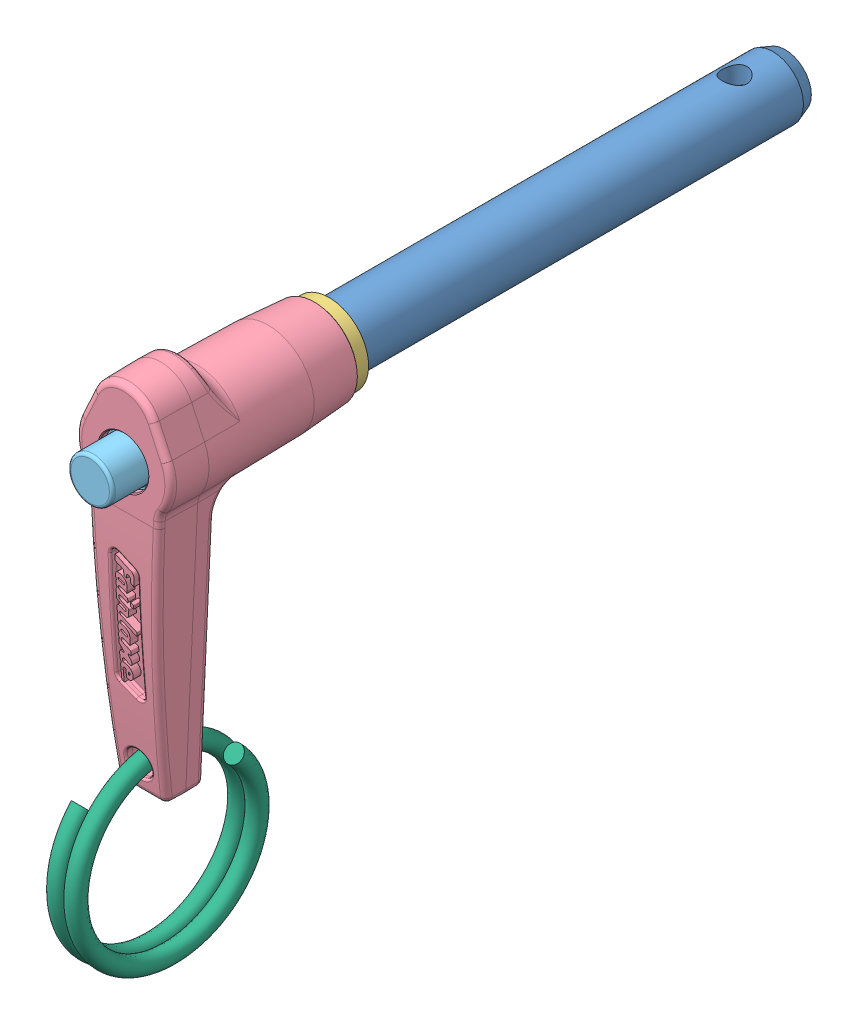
SolidWorks assembly Fixtureworks-LACH-31-200.SLDASM, configuration LACH-31-200 (file format 5000). Lengths in mm.
Overall size (13.17 73.21 99.46).
8 component instances, 6 part files, 0 mates.
Components (placement in the parent):
- Fixtureworks-LACH-31-200_LACH-31-050-1: Fixtureworks-LACH-31-200_LACH-31-050.SLDASM [LACH-31-200] at origin size (13.17 73.21 99.46)
  - Fixtureworks-LACH-31-200_SHAS-31-1: Fixtureworks-LACH-31-200_SHAS-31.SLDPRT [31-200] at origin size (7.9 7.9 66.74)
  - Fixtureworks-LACH-31-200_BALL-COMP-1: Fixtureworks-LACH-31-200_BALL-COMP.SLDPRT [BALL-125] at (0 -3.3147 6.528) x (0.318636 0 0.947877) z (0 -1 0) size (3.17 3.17 3.17)
  - Fixtureworks-LACH-31-200_BALL-COMP-2: Fixtureworks-LACH-31-200_BALL-COMP.SLDPRT [BALL-125] at (0 3.3147 6.528) x (-0.917573 0 -0.397568) z (0 -1 0) size (3.17 3.17 3.17)
  - Fixtureworks-LACH-31-200_WAC-COMP-1: Fixtureworks-LACH-31-200_WAC-COMP.SLDPRT [WAC-31] at (0 0 58.801) x (0.365093 -0.930971 0) z (0 0 1) size (10.16 10.16 1.78)
  - Fixtureworks-LACH-31-200_HALA-31-Mach-1: Fixtureworks-LACH-31-200_HALA-31-Mach.SLDPRT [HALA-31] at (0 0 60.325) size (12.39 47.04 25.02)
  - Fixtureworks-LACH-31-200_BUTA-31-1: Fixtureworks-LACH-31-200_BUTA-31.SLDPRT [BUTA-31] at (0 0 70.9613) x (0.995175 -0.098116 0) z (0 0 1) size (7.11 7.11 18.65)
  - Fixtureworks-LACH-31-200_RSC-37-1: Fixtureworks-LACH-31-200_RSC-37.SLDPRT [Default] at (-1.9844 -45.6521 80.8457) x (0 0.707107 -0.707107) z (-1 0 0) size (28.21 24.43 6.1)
